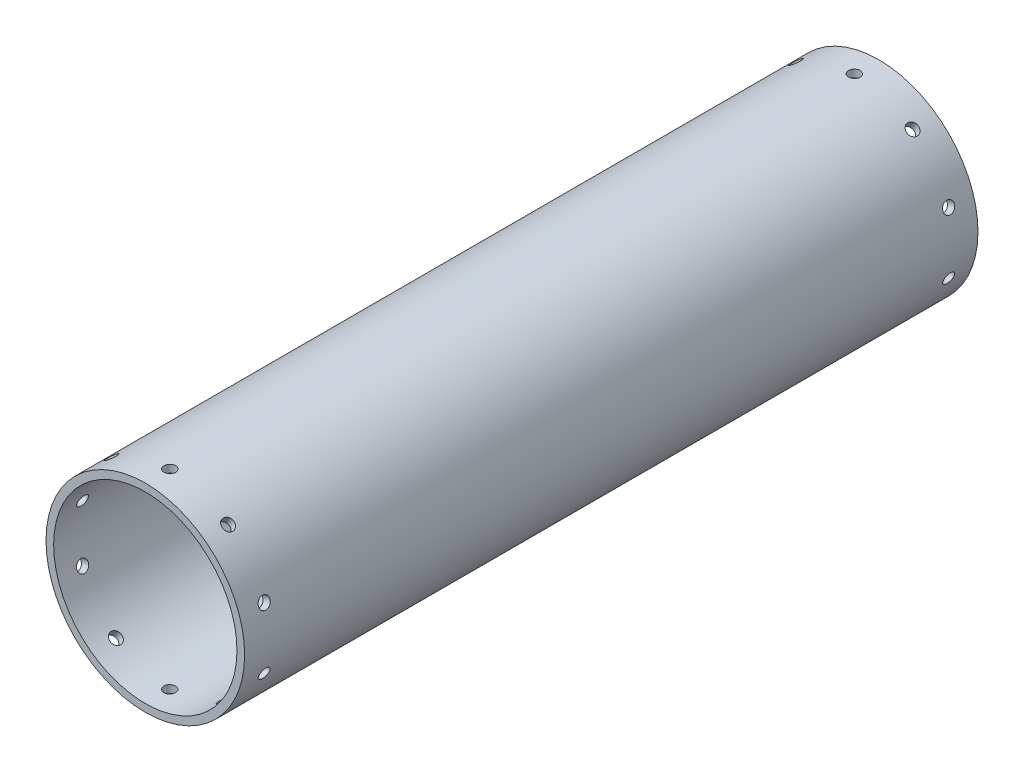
from build123d import *

# Parameters (mm, degrees)
SKETCH1_R               = 41.275
SKETCH1_R_2             = 38.1
BOSS_EXTRUDE2_DEPTH     = 304.8
CUT_EXTRUDE1_REACH      = 320.467
CUT_EXTRUDE1_END_RADIUS = 38.1
SKETCH4_R               = 2.413
CIRPATTERN1_COUNT       = 10
CUT_EXTRUDE2_REACH      = 320.467
CUT_EXTRUDE2_END_RADIUS = 38.1
SKETCH5_R               = 2.413
CIRPATTERN2_COUNT       = 10


with BuildPart() as part:
    # Sketch1 → Boss-Extrude2 (new body)
    with BuildSketch(Plane.XY):
        with Locations(Location((0, 0, 0), (0, 0, 180))):
            Circle(SKETCH1_R)
        with Locations(Location((0, 0, 0), (0, 0, 180))):
            Circle(SKETCH1_R_2, mode=Mode.SUBTRACT)
    extrude(amount=BOSS_EXTRUDE2_DEPTH)

    # Cut-Extrude1: up to this cylinder (the profile starts outside it)
    cut_extrude1_end = Plane(origin=(0, 0, 10.16), z_dir=(0, 0, -1)) * Cylinder(CUT_EXTRUDE1_END_RADIUS, 718.134, mode=Mode.PRIVATE)
    # Sketch4 → Cut-Extrude1 (cut, up to the surface)
    with BuildSketch(Plane(origin=(0, 41.275, 0), x_dir=(1, 0, 0), z_dir=(0, 1, 0)), mode=Mode.PRIVATE) as cut_extrude1_sk1:
        with Locations(Location((0, -10.16, 0), (0, 0, 270))):
            Circle(SKETCH4_R)
    cut_extrude1_tool1 = extrude(cut_extrude1_sk1.sketch, amount=-CUT_EXTRUDE1_REACH, mode=Mode.PRIVATE) - cut_extrude1_end
    cut_extrude1 = cut_extrude1_tool1.solids().sort_by_distance((0, 41.275, 10.16))[0]
    add(cut_extrude1, mode=Mode.SUBTRACT)

    # CirPattern1: Cut-Extrude1 ×10 about axis
    cirpattern1_axis = Axis((0, 0, 304.8), (0, 0, -1))
    for i in range(1, CIRPATTERN1_COUNT):
        add(cut_extrude1.rotate(cirpattern1_axis, i * 360 / CIRPATTERN1_COUNT), mode=Mode.SUBTRACT)

    # Cut-Extrude2: up to this cylinder (the profile starts outside it)
    cut_extrude2_end = Plane(origin=(0, 0, 294.64), z_dir=(0, 0, -1)) * Cylinder(CUT_EXTRUDE2_END_RADIUS, 718.134, mode=Mode.PRIVATE)
    # Sketch5 → Cut-Extrude2 (cut, up to the surface)
    with BuildSketch(Plane(origin=(0, 41.275, 0), x_dir=(1, 0, 0), z_dir=(0, 1, 0)), mode=Mode.PRIVATE) as cut_extrude2_sk1:
        with Locations(Location((0, -294.64, 0), (0, 0, 270))):
            Circle(SKETCH5_R)
    cut_extrude2_tool1 = extrude(cut_extrude2_sk1.sketch, amount=-CUT_EXTRUDE2_REACH, mode=Mode.PRIVATE) - cut_extrude2_end
    cut_extrude2 = cut_extrude2_tool1.solids().sort_by_distance((0, 41.275, 294.64))[0]
    add(cut_extrude2, mode=Mode.SUBTRACT)

    # CirPattern2: Cut-Extrude2 ×10 about axis
    cirpattern2_axis = Axis((0, 0, 304.8), (0, 0, -1))
    for i in range(1, CIRPATTERN2_COUNT):
        add(cut_extrude2.rotate(cirpattern2_axis, i * 360 / CIRPATTERN2_COUNT), mode=Mode.SUBTRACT)


solid = part.part
